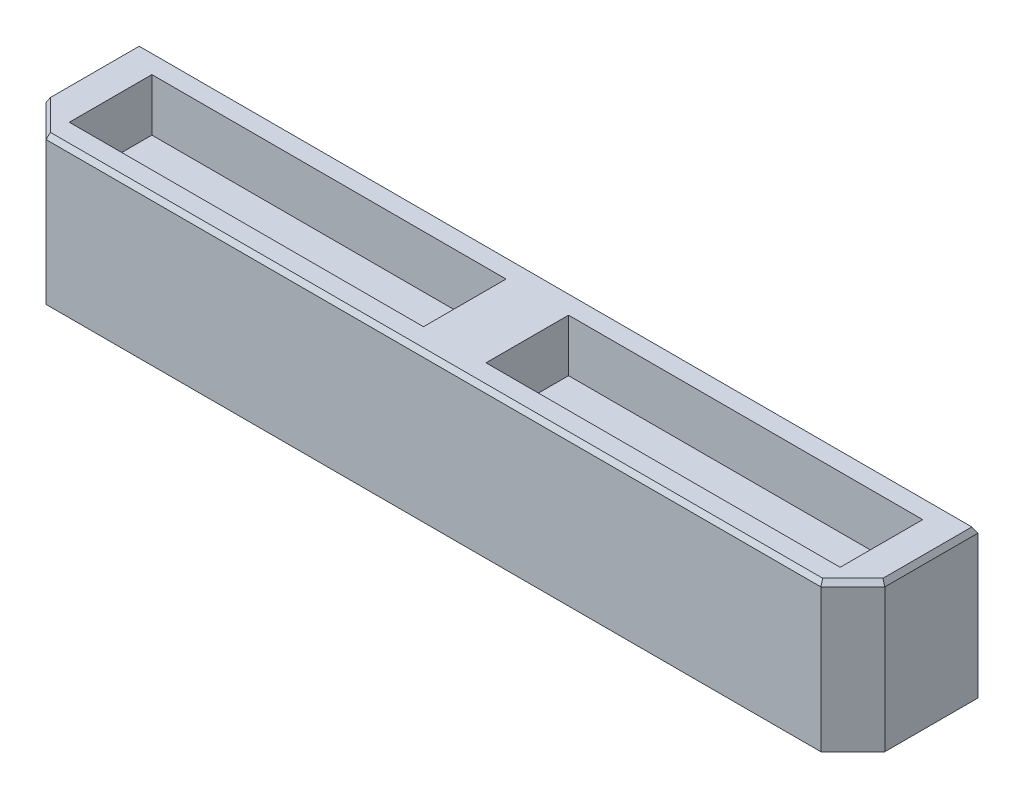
ISO-10303-21;
HEADER;
FILE_DESCRIPTION(('STEP AP214'),'2;1');
FILE_NAME('part.step','',(''),(''),'','','');
FILE_SCHEMA(('AUTOMOTIVE_DESIGN { 1 0 10303 214 1 1 1 1 }'));
ENDSEC;
DATA;
#1=APPLICATION_CONTEXT('core data for automotive mechanical design processes');
#2=APPLICATION_PROTOCOL_DEFINITION('international standard','automotive_design',2000,#1);
#3=PRODUCT_CONTEXT('',#1,'mechanical');
#4=PRODUCT('Part','Part','',(#3));
#5=PRODUCT_RELATED_PRODUCT_CATEGORY('part','',(#4));
#6=PRODUCT_DEFINITION_FORMATION('','',#4);
#7=PRODUCT_DEFINITION_CONTEXT('part definition',#1,'design');
#8=PRODUCT_DEFINITION('design','',#6,#7);
#9=PRODUCT_DEFINITION_SHAPE('','',#8);
#10=(LENGTH_UNIT() NAMED_UNIT(*) SI_UNIT(.MILLI.,.METRE.));
#11=(NAMED_UNIT(*) PLANE_ANGLE_UNIT() SI_UNIT($,.RADIAN.));
#12=(NAMED_UNIT(*) SI_UNIT($,.STERADIAN.) SOLID_ANGLE_UNIT());
#13=UNCERTAINTY_MEASURE_WITH_UNIT(LENGTH_MEASURE(1.E-05),#10,'distance_accuracy_value','');
#14=(GEOMETRIC_REPRESENTATION_CONTEXT(3) GLOBAL_UNCERTAINTY_ASSIGNED_CONTEXT((#13)) GLOBAL_UNIT_ASSIGNED_CONTEXT((#10,
#11,#12)) REPRESENTATION_CONTEXT('',''));
#15=CARTESIAN_POINT('',(0.,0.,0.));
#16=DIRECTION('',(0.,0.,1.));
#17=DIRECTION('',(1.,0.,0.));
#18=AXIS2_PLACEMENT_3D('',#15,#16,#17);
#19=CARTESIAN_POINT('',(-20.002500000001,7.26694,-2.98449999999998));
#20=DIRECTION('',(-1.,0.,0.));
#21=DIRECTION('',(0.,0.,1.));
#22=AXIS2_PLACEMENT_3D('',#19,#20,#21);
#23=PLANE('',#22);
#24=DIRECTION('',(0.,1.,0.));
#25=VECTOR('',#24,1.);
#26=CARTESIAN_POINT('',(-20.002500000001,7.26694,1.46050000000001));
#27=LINE('',#26,#25);
#28=CARTESIAN_POINT('',(-20.002500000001,0.203199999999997,1.46050000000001));
#29=VERTEX_POINT('',#28);
#30=CARTESIAN_POINT('',(-20.002500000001,7.01294,1.46050000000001));
#31=VERTEX_POINT('',#30);
#32=EDGE_CURVE('E245',#29,#31,#27,.T.);
#33=ORIENTED_EDGE('',*,*,#32,.T.);
#34=DIRECTION('',(0.,0.,-1.));
#35=VECTOR('',#34,1.);
#36=CARTESIAN_POINT('',(-20.002500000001,7.01294,-2.98449999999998));
#37=LINE('',#36,#35);
#38=CARTESIAN_POINT('',(-20.002500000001,7.01294,-2.98449999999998));
#39=VERTEX_POINT('',#38);
#40=EDGE_CURVE('E41',#31,#39,#37,.T.);
#41=ORIENTED_EDGE('',*,*,#40,.T.);
#42=DIRECTION('',(0.,-1.,0.));
#43=VECTOR('',#42,1.);
#44=CARTESIAN_POINT('',(-20.002500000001,7.26694,-2.98449999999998));
#45=LINE('',#44,#43);
#46=CARTESIAN_POINT('',(-20.002500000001,0.203199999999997,-2.98449999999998));
#47=VERTEX_POINT('',#46);
#48=EDGE_CURVE('E233',#39,#47,#45,.T.);
#49=ORIENTED_EDGE('',*,*,#48,.T.);
#50=DIRECTION('',(0.,0.,1.));
#51=VECTOR('',#50,1.);
#52=CARTESIAN_POINT('',(-20.002500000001,0.203199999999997,-2.98449999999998));
#53=LINE('',#52,#51);
#54=EDGE_CURVE('E238',#47,#29,#53,.T.);
#55=ORIENTED_EDGE('',*,*,#54,.T.);
#56=EDGE_LOOP('',(#33,#41,#49,#55));
#57=FACE_BOUND('',#56,.T.);
#58=ADVANCED_FACE('F34',(#57),#23,.T.);
#59=CARTESIAN_POINT('',(17.722849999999,7.26694,-2.98449999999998));
#60=DIRECTION('',(0.,1.,0.));
#61=DIRECTION('',(0.,0.,1.));
#62=AXIS2_PLACEMENT_3D('',#59,#60,#61);
#63=PLANE('',#62);
#64=DIRECTION('',(0.707106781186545,0.,0.70710678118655));
#65=VECTOR('',#64,1.);
#66=CARTESIAN_POINT('',(-3.25838030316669,7.26694,17.9967303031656));
#67=LINE('',#66,#65);
#68=CARTESIAN_POINT('',(-19.855500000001,7.26694,1.39961060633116));
#69=VERTEX_POINT('',#68);
#70=CARTESIAN_POINT('',(-18.4176106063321,7.26694,2.83750000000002));
#71=VERTEX_POINT('',#70);
#72=EDGE_CURVE('E263',#69,#71,#67,.T.);
#73=ORIENTED_EDGE('',*,*,#72,.T.);
#74=DIRECTION('',(1.,0.,0.));
#75=VECTOR('',#74,1.);
#76=CARTESIAN_POINT('',(17.722849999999,7.26694,2.83750000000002));
#77=LINE('',#76,#75);
#78=CARTESIAN_POINT('',(18.4176106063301,7.26694,2.83750000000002));
#79=VERTEX_POINT('',#78);
#80=EDGE_CURVE('E267',#71,#79,#77,.T.);
#81=ORIENTED_EDGE('',*,*,#80,.T.);
#82=DIRECTION('',(0.70710678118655,0.,-0.707106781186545));
#83=VECTOR('',#82,1.);
#84=CARTESIAN_POINT('',(20.9812303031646,7.26694,0.273880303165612));
#85=LINE('',#84,#83);
#86=CARTESIAN_POINT('',(19.855499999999,7.26694,1.39961060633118));
#87=VERTEX_POINT('',#86);
#88=EDGE_CURVE('E265',#79,#87,#85,.T.);
#89=ORIENTED_EDGE('',*,*,#88,.T.);
#90=DIRECTION('',(0.,0.,-1.));
#91=VECTOR('',#90,1.);
#92=CARTESIAN_POINT('',(19.855499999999,7.26694,-2.98449999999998));
#93=LINE('',#92,#91);
#94=CARTESIAN_POINT('',(19.855499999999,7.26694,-2.83749999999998));
#95=VERTEX_POINT('',#94);
#96=EDGE_CURVE('E261',#87,#95,#93,.T.);
#97=ORIENTED_EDGE('',*,*,#96,.T.);
#98=DIRECTION('',(-1.,0.,0.));
#99=VECTOR('',#98,1.);
#100=CARTESIAN_POINT('',(-20.002500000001,7.26694,-2.83749999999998));
#101=LINE('',#100,#99);
#102=CARTESIAN_POINT('',(-19.855500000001,7.26694,-2.83749999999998));
#103=VERTEX_POINT('',#102);
#104=EDGE_CURVE('E257',#95,#103,#101,.T.);
#105=ORIENTED_EDGE('',*,*,#104,.T.);
#106=DIRECTION('',(0.,0.,1.));
#107=VECTOR('',#106,1.);
#108=CARTESIAN_POINT('',(-19.855500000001,7.26694,-2.98449999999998));
#109=LINE('',#108,#107);
#110=EDGE_CURVE('E259',#103,#69,#109,.T.);
#111=ORIENTED_EDGE('',*,*,#110,.T.);
#112=EDGE_LOOP('',(#73,#81,#89,#97,#105,#111));
#113=FACE_BOUND('',#112,.T.);
#114=DIRECTION('',(0.,0.,-1.));
#115=VECTOR('',#114,1.);
#116=CARTESIAN_POINT('',(-1.490755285,7.26694,-1.9685));
#117=LINE('',#116,#115);
#118=CARTESIAN_POINT('',(-1.490755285,7.26694,1.9685));
#119=VERTEX_POINT('',#118);
#120=CARTESIAN_POINT('',(-1.490755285,7.26694,-1.9685));
#121=VERTEX_POINT('',#120);
#122=EDGE_CURVE('E171',#119,#121,#117,.T.);
#123=ORIENTED_EDGE('',*,*,#122,.F.);
#124=DIRECTION('',(1.,0.,0.));
#125=VECTOR('',#124,1.);
#126=CARTESIAN_POINT('',(-1.490755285,7.26694,1.9685));
#127=LINE('',#126,#125);
#128=CARTESIAN_POINT('',(-18.381755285,7.26694,1.9685));
#129=VERTEX_POINT('',#128);
#130=EDGE_CURVE('E176',#129,#119,#127,.T.);
#131=ORIENTED_EDGE('',*,*,#130,.F.);
#132=DIRECTION('',(0.,0.,1.));
#133=VECTOR('',#132,1.);
#134=CARTESIAN_POINT('',(-18.381755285,7.26694,1.9685));
#135=LINE('',#134,#133);
#136=CARTESIAN_POINT('',(-18.381755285,7.26694,-1.96849999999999));
#137=VERTEX_POINT('',#136);
#138=EDGE_CURVE('E155',#137,#129,#135,.T.);
#139=ORIENTED_EDGE('',*,*,#138,.F.);
#140=DIRECTION('',(-1.,0.,0.));
#141=VECTOR('',#140,1.);
#142=CARTESIAN_POINT('',(-18.381755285,7.26694,-1.96849999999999));
#143=LINE('',#142,#141);
#144=EDGE_CURVE('E167',#121,#137,#143,.T.);
#145=ORIENTED_EDGE('',*,*,#144,.F.);
#146=EDGE_LOOP('',(#123,#131,#139,#145));
#147=FACE_BOUND('',#146,.T.);
#148=DIRECTION('',(1.,0.,0.));
#149=VECTOR('',#148,1.);
#150=CARTESIAN_POINT('',(1.490755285,7.26694,1.9685));
#151=LINE('',#150,#149);
#152=CARTESIAN_POINT('',(1.490755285,7.26694,1.9685));
#153=VERTEX_POINT('',#152);
#154=CARTESIAN_POINT('',(18.381755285,7.26694,1.9685));
#155=VERTEX_POINT('',#154);
#156=EDGE_CURVE('E192',#153,#155,#151,.T.);
#157=ORIENTED_EDGE('',*,*,#156,.F.);
#158=DIRECTION('',(0.,0.,1.));
#159=VECTOR('',#158,1.);
#160=CARTESIAN_POINT('',(1.490755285,7.26694,-1.9685));
#161=LINE('',#160,#159);
#162=CARTESIAN_POINT('',(1.490755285,7.26694,-1.9685));
#163=VERTEX_POINT('',#162);
#164=EDGE_CURVE('E202',#163,#153,#161,.T.);
#165=ORIENTED_EDGE('',*,*,#164,.F.);
#166=DIRECTION('',(-1.,0.,0.));
#167=VECTOR('',#166,1.);
#168=CARTESIAN_POINT('',(18.381755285,7.26694,-1.9685));
#169=LINE('',#168,#167);
#170=CARTESIAN_POINT('',(18.381755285,7.26694,-1.9685));
#171=VERTEX_POINT('',#170);
#172=EDGE_CURVE('E199',#171,#163,#169,.T.);
#173=ORIENTED_EDGE('',*,*,#172,.F.);
#174=DIRECTION('',(0.,0.,-1.));
#175=VECTOR('',#174,1.);
#176=CARTESIAN_POINT('',(18.381755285,7.26694,1.9685));
#177=LINE('',#176,#175);
#178=EDGE_CURVE('E196',#155,#171,#177,.T.);
#179=ORIENTED_EDGE('',*,*,#178,.F.);
#180=EDGE_LOOP('',(#157,#165,#173,#179));
#181=FACE_BOUND('',#180,.T.);
#182=ADVANCED_FACE('F173',(#113,#147,#181),#63,.T.);
#183=CARTESIAN_POINT('',(-20.002500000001,0.203199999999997,-2.98449999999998));
#184=DIRECTION('',(0.,-1.,0.));
#185=DIRECTION('',(0.,0.,-1.));
#186=AXIS2_PLACEMENT_3D('',#183,#184,#185);
#187=PLANE('',#186);
#188=DIRECTION('',(0.,0.,-1.));
#189=VECTOR('',#188,1.);
#190=CARTESIAN_POINT('',(20.002499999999,0.203199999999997,-2.98449999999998));
#191=LINE('',#190,#189);
#192=CARTESIAN_POINT('',(20.002499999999,0.203199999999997,1.46050000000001));
#193=VERTEX_POINT('',#192);
#194=CARTESIAN_POINT('',(20.002499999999,0.203199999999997,-2.98449999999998));
#195=VERTEX_POINT('',#194);
#196=EDGE_CURVE('E220',#193,#195,#191,.T.);
#197=ORIENTED_EDGE('',*,*,#196,.F.);
#198=DIRECTION('',(-0.70710678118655,0.,0.707106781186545));
#199=VECTOR('',#198,1.);
#200=CARTESIAN_POINT('',(2.22249999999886,0.203199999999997,19.2405));
#201=LINE('',#200,#199);
#202=CARTESIAN_POINT('',(18.478499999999,0.203199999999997,2.98450000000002));
#203=VERTEX_POINT('',#202);
#204=EDGE_CURVE('E249',#193,#203,#201,.T.);
#205=ORIENTED_EDGE('',*,*,#204,.T.);
#206=DIRECTION('',(1.,0.,0.));
#207=VECTOR('',#206,1.);
#208=CARTESIAN_POINT('',(-20.002500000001,0.203199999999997,2.98450000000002));
#209=LINE('',#208,#207);
#210=CARTESIAN_POINT('',(-18.478500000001,0.203199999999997,2.98450000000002));
#211=VERTEX_POINT('',#210);
#212=EDGE_CURVE('E230',#211,#203,#209,.T.);
#213=ORIENTED_EDGE('',*,*,#212,.F.);
#214=DIRECTION('',(0.707106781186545,0.,0.70710678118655));
#215=VECTOR('',#214,1.);
#216=CARTESIAN_POINT('',(-22.225000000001,0.203199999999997,-0.762000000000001));
#217=LINE('',#216,#215);
#218=EDGE_CURVE('E243',#211,#29,#217,.F.);
#219=ORIENTED_EDGE('',*,*,#218,.T.);
#220=ORIENTED_EDGE('',*,*,#54,.F.);
#221=DIRECTION('',(1.,0.,0.));
#222=VECTOR('',#221,1.);
#223=CARTESIAN_POINT('',(-20.002500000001,0.203199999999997,-2.98449999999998));
#224=LINE('',#223,#222);
#225=EDGE_CURVE('E235',#47,#195,#224,.T.);
#226=ORIENTED_EDGE('',*,*,#225,.T.);
#227=EDGE_LOOP('',(#197,#205,#213,#219,#220,#226));
#228=FACE_BOUND('',#227,.T.);
#229=ADVANCED_FACE('F319',(#228),#187,.T.);
#230=CARTESIAN_POINT('',(-20.002500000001,0.203199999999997,-2.98449999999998));
#231=DIRECTION('',(0.,0.,1.));
#232=DIRECTION('',(1.,0.,0.));
#233=AXIS2_PLACEMENT_3D('',#230,#231,#232);
#234=PLANE('',#233);
#235=ORIENTED_EDGE('',*,*,#48,.F.);
#236=DIRECTION('',(1.,0.,0.));
#237=VECTOR('',#236,1.);
#238=CARTESIAN_POINT('',(20.002499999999,7.01294,-2.98449999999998));
#239=LINE('',#238,#237);
#240=CARTESIAN_POINT('',(20.002499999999,7.01294,-2.98449999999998));
#241=VERTEX_POINT('',#240);
#242=EDGE_CURVE('E11',#39,#241,#239,.T.);
#243=ORIENTED_EDGE('',*,*,#242,.T.);
#244=DIRECTION('',(0.,1.,0.));
#245=VECTOR('',#244,1.);
#246=CARTESIAN_POINT('',(20.002499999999,7.26694,-2.98449999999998));
#247=LINE('',#246,#245);
#248=EDGE_CURVE('E228',#195,#241,#247,.T.);
#249=ORIENTED_EDGE('',*,*,#248,.F.);
#250=ORIENTED_EDGE('',*,*,#225,.F.);
#251=EDGE_LOOP('',(#235,#243,#249,#250));
#252=FACE_BOUND('',#251,.T.);
#253=ADVANCED_FACE('F321',(#252),#234,.F.);
#254=CARTESIAN_POINT('',(-20.002500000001,0.203199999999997,2.98450000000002));
#255=DIRECTION('',(0.,0.,1.));
#256=DIRECTION('',(1.,0.,0.));
#257=AXIS2_PLACEMENT_3D('',#254,#255,#256);
#258=PLANE('',#257);
#259=DIRECTION('',(0.,1.,0.));
#260=VECTOR('',#259,1.);
#261=CARTESIAN_POINT('',(18.478499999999,7.26694,2.98450000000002));
#262=LINE('',#261,#260);
#263=CARTESIAN_POINT('',(18.478499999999,7.01294,2.98450000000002));
#264=VERTEX_POINT('',#263);
#265=EDGE_CURVE('E251',#203,#264,#262,.T.);
#266=ORIENTED_EDGE('',*,*,#265,.T.);
#267=DIRECTION('',(-1.,0.,0.));
#268=VECTOR('',#267,1.);
#269=CARTESIAN_POINT('',(-20.002500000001,7.01294,2.98450000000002));
#270=LINE('',#269,#268);
#271=CARTESIAN_POINT('',(-18.478500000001,7.01294,2.98450000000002));
#272=VERTEX_POINT('',#271);
#273=EDGE_CURVE('E254',#264,#272,#270,.T.);
#274=ORIENTED_EDGE('',*,*,#273,.T.);
#275=DIRECTION('',(0.,-1.,0.));
#276=VECTOR('',#275,1.);
#277=CARTESIAN_POINT('',(-18.478500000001,0.203199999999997,2.98450000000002));
#278=LINE('',#277,#276);
#279=EDGE_CURVE('E241',#272,#211,#278,.T.);
#280=ORIENTED_EDGE('',*,*,#279,.T.);
#281=ORIENTED_EDGE('',*,*,#212,.T.);
#282=EDGE_LOOP('',(#266,#274,#280,#281));
#283=FACE_BOUND('',#282,.T.);
#284=ADVANCED_FACE('F311',(#283),#258,.T.);
#285=CARTESIAN_POINT('',(20.002499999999,7.26694,2.98450000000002));
#286=DIRECTION('',(-1.,0.,0.));
#287=DIRECTION('',(0.,0.,1.));
#288=AXIS2_PLACEMENT_3D('',#285,#286,#287);
#289=PLANE('',#288);
#290=ORIENTED_EDGE('',*,*,#248,.T.);
#291=DIRECTION('',(0.,0.,1.));
#292=VECTOR('',#291,1.);
#293=CARTESIAN_POINT('',(20.002499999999,7.01294,1.46050000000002));
#294=LINE('',#293,#292);
#295=CARTESIAN_POINT('',(20.002499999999,7.01294,1.46050000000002));
#296=VERTEX_POINT('',#295);
#297=EDGE_CURVE('E274',#241,#296,#294,.T.);
#298=ORIENTED_EDGE('',*,*,#297,.T.);
#299=DIRECTION('',(0.,-1.,0.));
#300=VECTOR('',#299,1.);
#301=CARTESIAN_POINT('',(20.002499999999,0.203199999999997,1.46050000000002));
#302=LINE('',#301,#300);
#303=EDGE_CURVE('E247',#296,#193,#302,.T.);
#304=ORIENTED_EDGE('',*,*,#303,.T.);
#305=ORIENTED_EDGE('',*,*,#196,.T.);
#306=EDGE_LOOP('',(#290,#298,#304,#305));
#307=FACE_BOUND('',#306,.T.);
#308=ADVANCED_FACE('F278',(#307),#289,.F.);
#309=CARTESIAN_POINT('',(1.490755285,4.76694,1.9685));
#310=DIRECTION('',(0.,0.,1.));
#311=DIRECTION('',(1.,0.,0.));
#312=AXIS2_PLACEMENT_3D('',#309,#310,#311);
#313=PLANE('',#312);
#314=ORIENTED_EDGE('',*,*,#156,.T.);
#315=DIRECTION('',(0.,1.,0.));
#316=VECTOR('',#315,1.);
#317=CARTESIAN_POINT('',(18.381755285,4.76694,1.9685));
#318=LINE('',#317,#316);
#319=CARTESIAN_POINT('',(18.381755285,4.76694,1.9685));
#320=VERTEX_POINT('',#319);
#321=EDGE_CURVE('E217',#320,#155,#318,.T.);
#322=ORIENTED_EDGE('',*,*,#321,.F.);
#323=DIRECTION('',(1.,0.,0.));
#324=VECTOR('',#323,1.);
#325=CARTESIAN_POINT('',(1.490755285,4.76694,1.9685));
#326=LINE('',#325,#324);
#327=CARTESIAN_POINT('',(1.490755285,4.76694,1.9685));
#328=VERTEX_POINT('',#327);
#329=EDGE_CURVE('E205',#328,#320,#326,.T.);
#330=ORIENTED_EDGE('',*,*,#329,.F.);
#331=DIRECTION('',(0.,1.,0.));
#332=VECTOR('',#331,1.);
#333=CARTESIAN_POINT('',(1.490755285,4.76694,1.9685));
#334=LINE('',#333,#332);
#335=EDGE_CURVE('E218',#328,#153,#334,.T.);
#336=ORIENTED_EDGE('',*,*,#335,.T.);
#337=EDGE_LOOP('',(#314,#322,#330,#336));
#338=FACE_BOUND('',#337,.T.);
#339=ADVANCED_FACE('F383',(#338),#313,.F.);
#340=CARTESIAN_POINT('',(1.490755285,4.76694,-1.9685));
#341=DIRECTION('',(-1.,0.,0.));
#342=DIRECTION('',(0.,0.,1.));
#343=AXIS2_PLACEMENT_3D('',#340,#341,#342);
#344=PLANE('',#343);
#345=ORIENTED_EDGE('',*,*,#164,.T.);
#346=ORIENTED_EDGE('',*,*,#335,.F.);
#347=DIRECTION('',(0.,0.,1.));
#348=VECTOR('',#347,1.);
#349=CARTESIAN_POINT('',(1.490755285,4.76694,-1.9685));
#350=LINE('',#349,#348);
#351=CARTESIAN_POINT('',(1.490755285,4.76694,-1.9685));
#352=VERTEX_POINT('',#351);
#353=EDGE_CURVE('E214',#352,#328,#350,.T.);
#354=ORIENTED_EDGE('',*,*,#353,.F.);
#355=DIRECTION('',(0.,1.,0.));
#356=VECTOR('',#355,1.);
#357=CARTESIAN_POINT('',(1.490755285,4.76694,-1.9685));
#358=LINE('',#357,#356);
#359=EDGE_CURVE('E221',#352,#163,#358,.T.);
#360=ORIENTED_EDGE('',*,*,#359,.T.);
#361=EDGE_LOOP('',(#345,#346,#354,#360));
#362=FACE_BOUND('',#361,.T.);
#363=ADVANCED_FACE('F379',(#362),#344,.F.);
#364=CARTESIAN_POINT('',(18.381755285,4.76694,-1.9685));
#365=DIRECTION('',(0.,0.,-1.));
#366=DIRECTION('',(-1.,0.,0.));
#367=AXIS2_PLACEMENT_3D('',#364,#365,#366);
#368=PLANE('',#367);
#369=ORIENTED_EDGE('',*,*,#172,.T.);
#370=ORIENTED_EDGE('',*,*,#359,.F.);
#371=DIRECTION('',(-1.,0.,0.));
#372=VECTOR('',#371,1.);
#373=CARTESIAN_POINT('',(18.381755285,4.76694,-1.9685));
#374=LINE('',#373,#372);
#375=CARTESIAN_POINT('',(18.381755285,4.76694,-1.9685));
#376=VERTEX_POINT('',#375);
#377=EDGE_CURVE('E211',#376,#352,#374,.T.);
#378=ORIENTED_EDGE('',*,*,#377,.F.);
#379=DIRECTION('',(0.,1.,0.));
#380=VECTOR('',#379,1.);
#381=CARTESIAN_POINT('',(18.381755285,4.76694,-1.9685));
#382=LINE('',#381,#380);
#383=EDGE_CURVE('E223',#376,#171,#382,.T.);
#384=ORIENTED_EDGE('',*,*,#383,.T.);
#385=EDGE_LOOP('',(#369,#370,#378,#384));
#386=FACE_BOUND('',#385,.T.);
#387=ADVANCED_FACE('F382',(#386),#368,.F.);
#388=CARTESIAN_POINT('',(18.381755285,4.76694,1.9685));
#389=DIRECTION('',(1.,0.,0.));
#390=DIRECTION('',(0.,0.,-1.));
#391=AXIS2_PLACEMENT_3D('',#388,#389,#390);
#392=PLANE('',#391);
#393=ORIENTED_EDGE('',*,*,#178,.T.);
#394=ORIENTED_EDGE('',*,*,#383,.F.);
#395=DIRECTION('',(0.,0.,-1.));
#396=VECTOR('',#395,1.);
#397=CARTESIAN_POINT('',(18.381755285,4.76694,1.9685));
#398=LINE('',#397,#396);
#399=EDGE_CURVE('E208',#320,#376,#398,.T.);
#400=ORIENTED_EDGE('',*,*,#399,.F.);
#401=ORIENTED_EDGE('',*,*,#321,.T.);
#402=EDGE_LOOP('',(#393,#394,#400,#401));
#403=FACE_BOUND('',#402,.T.);
#404=ADVANCED_FACE('F377',(#403),#392,.F.);
#405=CARTESIAN_POINT('',(1.490755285,4.76694,1.9685));
#406=DIRECTION('',(0.,-1.,0.));
#407=DIRECTION('',(0.,0.,-1.));
#408=AXIS2_PLACEMENT_3D('',#405,#406,#407);
#409=PLANE('',#408);
#410=ORIENTED_EDGE('',*,*,#329,.T.);
#411=ORIENTED_EDGE('',*,*,#399,.T.);
#412=ORIENTED_EDGE('',*,*,#377,.T.);
#413=ORIENTED_EDGE('',*,*,#353,.T.);
#414=EDGE_LOOP('',(#410,#411,#412,#413));
#415=FACE_BOUND('',#414,.T.);
#416=ADVANCED_FACE('F374',(#415),#409,.F.);
#417=CARTESIAN_POINT('',(-1.490755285,4.76694,-1.9685));
#418=DIRECTION('',(1.,0.,0.));
#419=DIRECTION('',(0.,0.,-1.));
#420=AXIS2_PLACEMENT_3D('',#417,#418,#419);
#421=PLANE('',#420);
#422=ORIENTED_EDGE('',*,*,#122,.T.);
#423=DIRECTION('',(0.,1.,0.));
#424=VECTOR('',#423,1.);
#425=CARTESIAN_POINT('',(-1.490755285,4.76694,-1.9685));
#426=LINE('',#425,#424);
#427=CARTESIAN_POINT('',(-1.490755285,4.76694,-1.9685));
#428=VERTEX_POINT('',#427);
#429=EDGE_CURVE('E163',#428,#121,#426,.T.);
#430=ORIENTED_EDGE('',*,*,#429,.F.);
#431=DIRECTION('',(0.,0.,-1.));
#432=VECTOR('',#431,1.);
#433=CARTESIAN_POINT('',(-1.490755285,4.76694,-1.9685));
#434=LINE('',#433,#432);
#435=CARTESIAN_POINT('',(-1.490755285,4.76694,1.9685));
#436=VERTEX_POINT('',#435);
#437=EDGE_CURVE('E178',#436,#428,#434,.T.);
#438=ORIENTED_EDGE('',*,*,#437,.F.);
#439=DIRECTION('',(0.,1.,0.));
#440=VECTOR('',#439,1.);
#441=CARTESIAN_POINT('',(-1.490755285,4.76694,1.9685));
#442=LINE('',#441,#440);
#443=EDGE_CURVE('E190',#436,#119,#442,.T.);
#444=ORIENTED_EDGE('',*,*,#443,.T.);
#445=EDGE_LOOP('',(#422,#430,#438,#444));
#446=FACE_BOUND('',#445,.T.);
#447=ADVANCED_FACE('F351',(#446),#421,.F.);
#448=CARTESIAN_POINT('',(-1.490755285,4.76694,1.9685));
#449=DIRECTION('',(0.,0.,1.));
#450=DIRECTION('',(1.,0.,0.));
#451=AXIS2_PLACEMENT_3D('',#448,#449,#450);
#452=PLANE('',#451);
#453=ORIENTED_EDGE('',*,*,#130,.T.);
#454=ORIENTED_EDGE('',*,*,#443,.F.);
#455=DIRECTION('',(1.,0.,0.));
#456=VECTOR('',#455,1.);
#457=CARTESIAN_POINT('',(-1.490755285,4.76694,1.9685));
#458=LINE('',#457,#456);
#459=CARTESIAN_POINT('',(-18.381755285,4.76694,1.9685));
#460=VERTEX_POINT('',#459);
#461=EDGE_CURVE('E187',#460,#436,#458,.T.);
#462=ORIENTED_EDGE('',*,*,#461,.F.);
#463=DIRECTION('',(0.,1.,0.));
#464=VECTOR('',#463,1.);
#465=CARTESIAN_POINT('',(-18.381755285,4.76694,1.9685));
#466=LINE('',#465,#464);
#467=EDGE_CURVE('E162',#460,#129,#466,.T.);
#468=ORIENTED_EDGE('',*,*,#467,.T.);
#469=EDGE_LOOP('',(#453,#454,#462,#468));
#470=FACE_BOUND('',#469,.T.);
#471=ADVANCED_FACE('F355',(#470),#452,.F.);
#472=CARTESIAN_POINT('',(-18.381755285,4.76694,1.9685));
#473=DIRECTION('',(-1.,0.,0.));
#474=DIRECTION('',(0.,0.,1.));
#475=AXIS2_PLACEMENT_3D('',#472,#473,#474);
#476=PLANE('',#475);
#477=ORIENTED_EDGE('',*,*,#138,.T.);
#478=ORIENTED_EDGE('',*,*,#467,.F.);
#479=DIRECTION('',(0.,0.,1.));
#480=VECTOR('',#479,1.);
#481=CARTESIAN_POINT('',(-18.381755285,4.76694,1.9685));
#482=LINE('',#481,#480);
#483=CARTESIAN_POINT('',(-18.381755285,4.76694,-1.96849999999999));
#484=VERTEX_POINT('',#483);
#485=EDGE_CURVE('E158',#484,#460,#482,.T.);
#486=ORIENTED_EDGE('',*,*,#485,.F.);
#487=DIRECTION('',(0.,1.,0.));
#488=VECTOR('',#487,1.);
#489=CARTESIAN_POINT('',(-18.381755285,4.76694,-1.96849999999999));
#490=LINE('',#489,#488);
#491=EDGE_CURVE('E151',#484,#137,#490,.T.);
#492=ORIENTED_EDGE('',*,*,#491,.T.);
#493=EDGE_LOOP('',(#477,#478,#486,#492));
#494=FACE_BOUND('',#493,.T.);
#495=ADVANCED_FACE('F153',(#494),#476,.F.);
#496=CARTESIAN_POINT('',(-18.381755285,4.76694,-1.96849999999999));
#497=DIRECTION('',(0.,0.,-1.));
#498=DIRECTION('',(-1.,0.,0.));
#499=AXIS2_PLACEMENT_3D('',#496,#497,#498);
#500=PLANE('',#499);
#501=ORIENTED_EDGE('',*,*,#144,.T.);
#502=ORIENTED_EDGE('',*,*,#491,.F.);
#503=DIRECTION('',(-1.,0.,0.));
#504=VECTOR('',#503,1.);
#505=CARTESIAN_POINT('',(-18.381755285,4.76694,-1.96849999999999));
#506=LINE('',#505,#504);
#507=EDGE_CURVE('E184',#428,#484,#506,.T.);
#508=ORIENTED_EDGE('',*,*,#507,.F.);
#509=ORIENTED_EDGE('',*,*,#429,.T.);
#510=EDGE_LOOP('',(#501,#502,#508,#509));
#511=FACE_BOUND('',#510,.T.);
#512=ADVANCED_FACE('F168',(#511),#500,.F.);
#513=CARTESIAN_POINT('',(-1.490755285,4.76694,1.9685));
#514=DIRECTION('',(0.,-1.,0.));
#515=DIRECTION('',(0.,0.,-1.));
#516=AXIS2_PLACEMENT_3D('',#513,#514,#515);
#517=PLANE('',#516);
#518=ORIENTED_EDGE('',*,*,#437,.T.);
#519=ORIENTED_EDGE('',*,*,#507,.T.);
#520=ORIENTED_EDGE('',*,*,#485,.T.);
#521=ORIENTED_EDGE('',*,*,#461,.T.);
#522=EDGE_LOOP('',(#518,#519,#520,#521));
#523=FACE_BOUND('',#522,.T.);
#524=ADVANCED_FACE('F357',(#523),#517,.F.);
#525=CARTESIAN_POINT('',(-18.478500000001,0.203199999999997,2.98450000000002));
#526=DIRECTION('',(0.70710678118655,0.,-0.707106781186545));
#527=DIRECTION('',(-0.707106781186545,0.,-0.70710678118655));
#528=AXIS2_PLACEMENT_3D('',#525,#526,#527);
#529=PLANE('',#528);
#530=ORIENTED_EDGE('',*,*,#279,.F.);
#531=DIRECTION('',(0.707106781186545,0.,0.70710678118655));
#532=VECTOR('',#531,1.);
#533=CARTESIAN_POINT('',(-18.478500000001,7.01294,2.98450000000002));
#534=LINE('',#533,#532);
#535=EDGE_CURVE('E272',#272,#31,#534,.F.);
#536=ORIENTED_EDGE('',*,*,#535,.T.);
#537=ORIENTED_EDGE('',*,*,#32,.F.);
#538=ORIENTED_EDGE('',*,*,#218,.F.);
#539=EDGE_LOOP('',(#530,#536,#537,#538));
#540=FACE_BOUND('',#539,.T.);
#541=ADVANCED_FACE('F314',(#540),#529,.F.);
#542=CARTESIAN_POINT('',(20.002499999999,7.26694,1.46050000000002));
#543=DIRECTION('',(0.707106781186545,0.,0.70710678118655));
#544=DIRECTION('',(0.70710678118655,0.,-0.707106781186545));
#545=AXIS2_PLACEMENT_3D('',#542,#543,#544);
#546=PLANE('',#545);
#547=ORIENTED_EDGE('',*,*,#303,.F.);
#548=DIRECTION('',(-0.70710678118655,0.,0.707106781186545));
#549=VECTOR('',#548,1.);
#550=CARTESIAN_POINT('',(20.002499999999,7.01294,1.46050000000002));
#551=LINE('',#550,#549);
#552=EDGE_CURVE('E270',#296,#264,#551,.T.);
#553=ORIENTED_EDGE('',*,*,#552,.T.);
#554=ORIENTED_EDGE('',*,*,#265,.F.);
#555=ORIENTED_EDGE('',*,*,#204,.F.);
#556=EDGE_LOOP('',(#547,#553,#554,#555));
#557=FACE_BOUND('',#556,.T.);
#558=ADVANCED_FACE('F285',(#557),#546,.T.);
#559=CARTESIAN_POINT('',(17.722849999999,7.26694,-2.83749999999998));
#560=DIRECTION('',(0.,0.500901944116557,-0.865504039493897));
#561=DIRECTION('',(0.,0.865504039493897,0.500901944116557));
#562=AXIS2_PLACEMENT_3D('',#559,#560,#561);
#563=PLANE('',#562);
#564=DIRECTION('',(-0.447858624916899,-0.773850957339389,-0.447858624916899));
#565=VECTOR('',#564,1.);
#566=CARTESIAN_POINT('',(-12.318134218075,20.2906876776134,4.69986578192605));
#567=LINE('',#566,#565);
#568=EDGE_CURVE('E295',#103,#39,#567,.T.);
#569=ORIENTED_EDGE('',*,*,#568,.F.);
#570=ORIENTED_EDGE('',*,*,#104,.F.);
#571=DIRECTION('',(0.447858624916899,-0.773850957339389,-0.447858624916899));
#572=VECTOR('',#571,1.);
#573=CARTESIAN_POINT('',(19.4277387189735,8.00606493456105,-2.40973871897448));
#574=LINE('',#573,#572);
#575=EDGE_CURVE('E349',#241,#95,#574,.F.);
#576=ORIENTED_EDGE('',*,*,#575,.F.);
#577=ORIENTED_EDGE('',*,*,#242,.F.);
#578=EDGE_LOOP('',(#569,#570,#576,#577));
#579=FACE_BOUND('',#578,.T.);
#580=ADVANCED_FACE('F508',(#579),#563,.T.);
#581=CARTESIAN_POINT('',(20.002499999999,7.01294,2.98450000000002));
#582=DIRECTION('',(0.865504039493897,0.500901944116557,0.));
#583=DIRECTION('',(-0.500901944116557,0.865504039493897,0.));
#584=AXIS2_PLACEMENT_3D('',#581,#582,#583);
#585=PLANE('',#584);
#586=ORIENTED_EDGE('',*,*,#575,.T.);
#587=ORIENTED_EDGE('',*,*,#96,.F.);
#588=DIRECTION('',(-0.490456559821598,0.847455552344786,-0.203153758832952));
#589=VECTOR('',#588,1.);
#590=CARTESIAN_POINT('',(20.1543484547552,6.75056239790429,1.52339768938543));
#591=LINE('',#590,#589);
#592=EDGE_CURVE('E291',#296,#87,#591,.T.);
#593=ORIENTED_EDGE('',*,*,#592,.F.);
#594=ORIENTED_EDGE('',*,*,#297,.F.);
#595=EDGE_LOOP('',(#586,#587,#593,#594));
#596=FACE_BOUND('',#595,.T.);
#597=ADVANCED_FACE('F292',(#596),#585,.T.);
#598=CARTESIAN_POINT('',(-19.855500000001,7.26694,-2.98449999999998));
#599=DIRECTION('',(0.865504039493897,-0.500901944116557,0.));
#600=DIRECTION('',(0.500901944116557,0.865504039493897,0.));
#601=AXIS2_PLACEMENT_3D('',#598,#599,#600);
#602=PLANE('',#601);
#603=ORIENTED_EDGE('',*,*,#568,.T.);
#604=ORIENTED_EDGE('',*,*,#40,.F.);
#605=DIRECTION('',(-0.490456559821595,-0.847455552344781,0.20315375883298));
#606=VECTOR('',#605,1.);
#607=CARTESIAN_POINT('',(-19.4186755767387,8.02172505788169,1.21867200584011));
#608=LINE('',#607,#606);
#609=EDGE_CURVE('E296',#69,#31,#608,.T.);
#610=ORIENTED_EDGE('',*,*,#609,.F.);
#611=ORIENTED_EDGE('',*,*,#110,.F.);
#612=EDGE_LOOP('',(#603,#604,#610,#611));
#613=FACE_BOUND('',#612,.T.);
#614=ADVANCED_FACE('F339',(#613),#602,.F.);
#615=CARTESIAN_POINT('',(20.9812303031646,7.26694,0.273880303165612));
#616=DIRECTION('',(-0.612003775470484,-0.500901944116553,-0.612003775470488));
#617=DIRECTION('',(-0.70710678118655,0.,0.707106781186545));
#618=AXIS2_PLACEMENT_3D('',#615,#616,#617);
#619=PLANE('',#618);
#620=ORIENTED_EDGE('',*,*,#592,.T.);
#621=ORIENTED_EDGE('',*,*,#88,.F.);
#622=DIRECTION('',(0.20315375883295,-0.847455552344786,0.490456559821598));
#623=VECTOR('',#622,1.);
#624=CARTESIAN_POINT('',(18.267980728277,7.89112077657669,2.47626151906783));
#625=LINE('',#624,#623);
#626=EDGE_CURVE('E300',#264,#79,#625,.F.);
#627=ORIENTED_EDGE('',*,*,#626,.F.);
#628=ORIENTED_EDGE('',*,*,#552,.F.);
#629=EDGE_LOOP('',(#620,#621,#627,#628));
#630=FACE_BOUND('',#629,.T.);
#631=ADVANCED_FACE('F299',(#630),#619,.F.);
#632=CARTESIAN_POINT('',(-3.2583803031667,7.26694,17.9967303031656));
#633=DIRECTION('',(-0.612003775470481,0.50090194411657,0.612003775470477));
#634=DIRECTION('',(0.707106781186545,0.,0.70710678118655));
#635=AXIS2_PLACEMENT_3D('',#632,#633,#634);
#636=PLANE('',#635);
#637=ORIENTED_EDGE('',*,*,#609,.T.);
#638=ORIENTED_EDGE('',*,*,#535,.F.);
#639=DIRECTION('',(-0.203153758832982,-0.847455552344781,0.490456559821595));
#640=VECTOR('',#639,1.);
#641=CARTESIAN_POINT('',(-19.3024040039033,3.5760258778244,4.97358022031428));
#642=LINE('',#641,#640);
#643=EDGE_CURVE('E304',#71,#272,#642,.T.);
#644=ORIENTED_EDGE('',*,*,#643,.F.);
#645=ORIENTED_EDGE('',*,*,#72,.F.);
#646=EDGE_LOOP('',(#637,#638,#644,#645));
#647=FACE_BOUND('',#646,.T.);
#648=ADVANCED_FACE('F344',(#647),#636,.T.);
#649=CARTESIAN_POINT('',(-20.002500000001,7.01294,2.98450000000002));
#650=DIRECTION('',(0.,-0.500901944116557,-0.865504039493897));
#651=DIRECTION('',(0.,0.865504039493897,-0.500901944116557));
#652=AXIS2_PLACEMENT_3D('',#649,#650,#651);
#653=PLANE('',#652);
#654=ORIENTED_EDGE('',*,*,#626,.T.);
#655=ORIENTED_EDGE('',*,*,#80,.F.);
#656=ORIENTED_EDGE('',*,*,#643,.T.);
#657=ORIENTED_EDGE('',*,*,#273,.F.);
#658=EDGE_LOOP('',(#654,#655,#656,#657));
#659=FACE_BOUND('',#658,.T.);
#660=ADVANCED_FACE('F306',(#659),#653,.F.);
#661=CLOSED_SHELL('',(#58,#182,#229,#253,#284,#308,#339,#363,#387,#404,#416,#447,#471,#495,#512,
#524,#541,#558,#580,#597,#614,#631,#648,#660));
#662=MANIFOLD_SOLID_BREP('B2',#661);
#663=ADVANCED_BREP_SHAPE_REPRESENTATION('',(#18,#662),#14);
#664=SHAPE_DEFINITION_REPRESENTATION(#9,#663);
ENDSEC;
END-ISO-10303-21;
